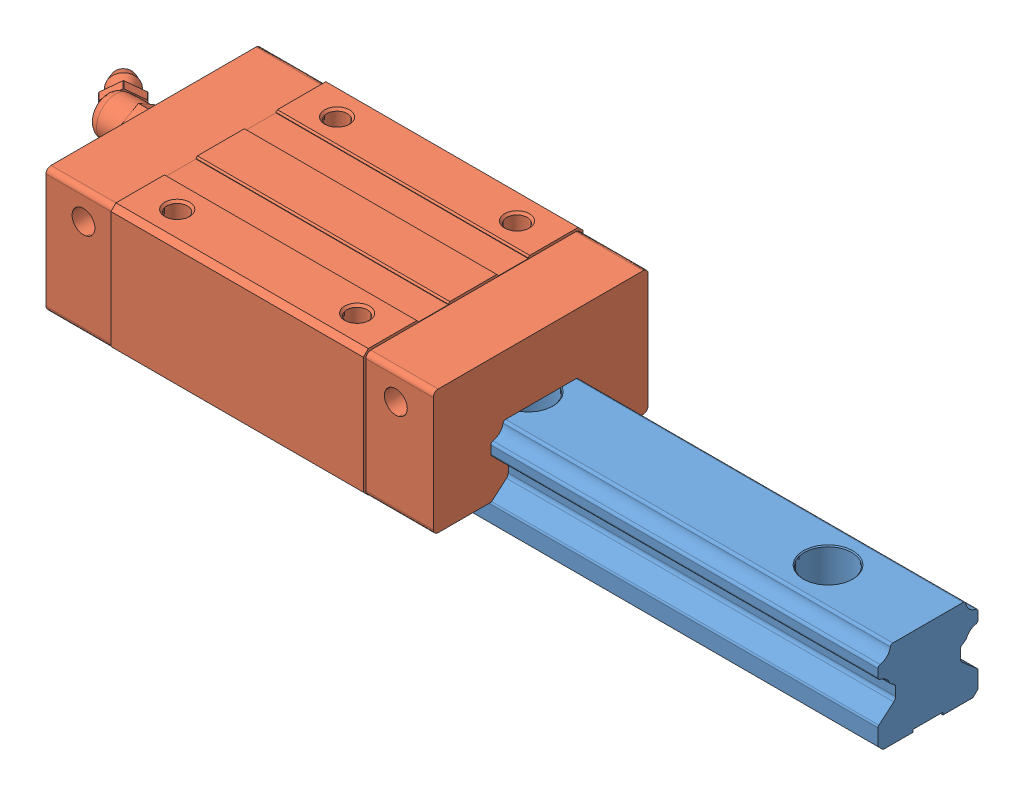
SolidWorks assembly HLH20CA.stp.sldasm, configuration 默认 (file format 13000). Lengths in mm.
Overall size (169.43 30 44).
2 component instances, 2 part files, 0 mates.
Components (placement in the parent):
- HLR20R160 E=20-1: HLR20R160 E=20.SLDPRT [默认] at origin size (160 17.5 20)
- HLH20CA-1: HLH20CA.SLDPRT [默认] at (5 4.6 0) size (91.93 25.4 44)
